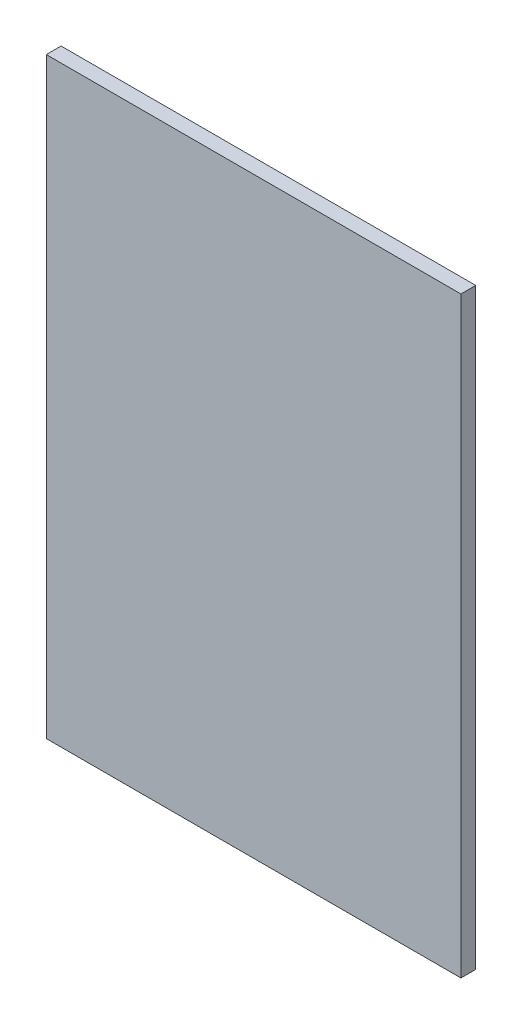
ISO-10303-21;
HEADER;
FILE_DESCRIPTION(('STEP AP214'),'2;1');
FILE_NAME('part.step','',(''),(''),'','','');
FILE_SCHEMA(('AUTOMOTIVE_DESIGN { 1 0 10303 214 1 1 1 1 }'));
ENDSEC;
DATA;
#1=APPLICATION_CONTEXT('core data for automotive mechanical design processes');
#2=APPLICATION_PROTOCOL_DEFINITION('international standard','automotive_design',2000,#1);
#3=PRODUCT_CONTEXT('',#1,'mechanical');
#4=PRODUCT('Part','Part','',(#3));
#5=PRODUCT_RELATED_PRODUCT_CATEGORY('part','',(#4));
#6=PRODUCT_DEFINITION_FORMATION('','',#4);
#7=PRODUCT_DEFINITION_CONTEXT('part definition',#1,'design');
#8=PRODUCT_DEFINITION('design','',#6,#7);
#9=PRODUCT_DEFINITION_SHAPE('','',#8);
#10=(LENGTH_UNIT() NAMED_UNIT(*) SI_UNIT(.MILLI.,.METRE.));
#11=(NAMED_UNIT(*) PLANE_ANGLE_UNIT() SI_UNIT($,.RADIAN.));
#12=(NAMED_UNIT(*) SI_UNIT($,.STERADIAN.) SOLID_ANGLE_UNIT());
#13=UNCERTAINTY_MEASURE_WITH_UNIT(LENGTH_MEASURE(1.E-05),#10,'distance_accuracy_value','');
#14=(GEOMETRIC_REPRESENTATION_CONTEXT(3) GLOBAL_UNCERTAINTY_ASSIGNED_CONTEXT((#13)) GLOBAL_UNIT_ASSIGNED_CONTEXT((#10,
#11,#12)) REPRESENTATION_CONTEXT('',''));
#15=CARTESIAN_POINT('',(0.,0.,0.));
#16=DIRECTION('',(0.,0.,1.));
#17=DIRECTION('',(1.,0.,0.));
#18=AXIS2_PLACEMENT_3D('',#15,#16,#17);
#19=CARTESIAN_POINT('',(177.8,-127.,0.));
#20=DIRECTION('',(0.,1.,0.));
#21=DIRECTION('',(0.,0.,1.));
#22=AXIS2_PLACEMENT_3D('',#19,#20,#21);
#23=PLANE('',#22);
#24=DIRECTION('',(0.,0.,-1.));
#25=VECTOR('',#24,1.);
#26=CARTESIAN_POINT('',(0.,-127.,0.));
#27=LINE('',#26,#25);
#28=CARTESIAN_POINT('',(0.,-127.,0.));
#29=VERTEX_POINT('',#28);
#30=CARTESIAN_POINT('',(0.,-127.,-6.34999999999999));
#31=VERTEX_POINT('',#30);
#32=EDGE_CURVE('E115',#29,#31,#27,.T.);
#33=ORIENTED_EDGE('',*,*,#32,.T.);
#34=DIRECTION('',(-1.,0.,0.));
#35=VECTOR('',#34,1.);
#36=CARTESIAN_POINT('',(177.8,-127.,-6.34999999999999));
#37=LINE('',#36,#35);
#38=CARTESIAN_POINT('',(177.8,-127.,-6.34999999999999));
#39=VERTEX_POINT('',#38);
#40=EDGE_CURVE('E11',#39,#31,#37,.T.);
#41=ORIENTED_EDGE('',*,*,#40,.F.);
#42=DIRECTION('',(0.,0.,-1.));
#43=VECTOR('',#42,1.);
#44=CARTESIAN_POINT('',(177.8,-127.,0.));
#45=LINE('',#44,#43);
#46=CARTESIAN_POINT('',(177.8,-127.,0.));
#47=VERTEX_POINT('',#46);
#48=EDGE_CURVE('E94',#47,#39,#45,.T.);
#49=ORIENTED_EDGE('',*,*,#48,.F.);
#50=DIRECTION('',(-1.,0.,0.));
#51=VECTOR('',#50,1.);
#52=CARTESIAN_POINT('',(177.8,-127.,0.));
#53=LINE('',#52,#51);
#54=EDGE_CURVE('E106',#47,#29,#53,.T.);
#55=ORIENTED_EDGE('',*,*,#54,.T.);
#56=EDGE_LOOP('',(#33,#41,#49,#55));
#57=FACE_BOUND('',#56,.T.);
#58=ADVANCED_FACE('F43',(#57),#23,.F.);
#59=CARTESIAN_POINT('',(177.8,-127.,-6.34999999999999));
#60=DIRECTION('',(0.,0.,1.));
#61=DIRECTION('',(1.,0.,0.));
#62=AXIS2_PLACEMENT_3D('',#59,#60,#61);
#63=PLANE('',#62);
#64=DIRECTION('',(0.,1.,0.));
#65=VECTOR('',#64,1.);
#66=CARTESIAN_POINT('',(0.,-127.,-6.34999999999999));
#67=LINE('',#66,#65);
#68=CARTESIAN_POINT('',(0.,127.,-6.34999999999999));
#69=VERTEX_POINT('',#68);
#70=EDGE_CURVE('E99',#31,#69,#67,.T.);
#71=ORIENTED_EDGE('',*,*,#70,.T.);
#72=DIRECTION('',(-1.,0.,0.));
#73=VECTOR('',#72,1.);
#74=CARTESIAN_POINT('',(177.8,127.,-6.34999999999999));
#75=LINE('',#74,#73);
#76=CARTESIAN_POINT('',(177.8,127.,-6.34999999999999));
#77=VERTEX_POINT('',#76);
#78=EDGE_CURVE('E55',#77,#69,#75,.T.);
#79=ORIENTED_EDGE('',*,*,#78,.F.);
#80=DIRECTION('',(0.,1.,0.));
#81=VECTOR('',#80,1.);
#82=CARTESIAN_POINT('',(177.8,-127.,-6.34999999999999));
#83=LINE('',#82,#81);
#84=EDGE_CURVE('E89',#39,#77,#83,.T.);
#85=ORIENTED_EDGE('',*,*,#84,.F.);
#86=ORIENTED_EDGE('',*,*,#40,.T.);
#87=EDGE_LOOP('',(#71,#79,#85,#86));
#88=FACE_BOUND('',#87,.T.);
#89=ADVANCED_FACE('F98',(#88),#63,.F.);
#90=CARTESIAN_POINT('',(177.8,127.,-6.34999999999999));
#91=DIRECTION('',(0.,-1.,0.));
#92=DIRECTION('',(0.,0.,-1.));
#93=AXIS2_PLACEMENT_3D('',#90,#91,#92);
#94=PLANE('',#93);
#95=DIRECTION('',(0.,0.,1.));
#96=VECTOR('',#95,1.);
#97=CARTESIAN_POINT('',(0.,127.,-6.34999999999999));
#98=LINE('',#97,#96);
#99=CARTESIAN_POINT('',(0.,127.,0.));
#100=VERTEX_POINT('',#99);
#101=EDGE_CURVE('E77',#69,#100,#98,.T.);
#102=ORIENTED_EDGE('',*,*,#101,.T.);
#103=DIRECTION('',(-1.,0.,0.));
#104=VECTOR('',#103,1.);
#105=CARTESIAN_POINT('',(177.8,127.,0.));
#106=LINE('',#105,#104);
#107=CARTESIAN_POINT('',(177.8,127.,0.));
#108=VERTEX_POINT('',#107);
#109=EDGE_CURVE('E105',#108,#100,#106,.T.);
#110=ORIENTED_EDGE('',*,*,#109,.F.);
#111=DIRECTION('',(0.,0.,1.));
#112=VECTOR('',#111,1.);
#113=CARTESIAN_POINT('',(177.8,127.,-6.34999999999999));
#114=LINE('',#113,#112);
#115=EDGE_CURVE('E93',#77,#108,#114,.T.);
#116=ORIENTED_EDGE('',*,*,#115,.F.);
#117=ORIENTED_EDGE('',*,*,#78,.T.);
#118=EDGE_LOOP('',(#102,#110,#116,#117));
#119=FACE_BOUND('',#118,.T.);
#120=ADVANCED_FACE('F104',(#119),#94,.F.);
#121=CARTESIAN_POINT('',(177.8,127.,0.));
#122=DIRECTION('',(0.,0.,-1.));
#123=DIRECTION('',(-1.,0.,0.));
#124=AXIS2_PLACEMENT_3D('',#121,#122,#123);
#125=PLANE('',#124);
#126=DIRECTION('',(0.,-1.,0.));
#127=VECTOR('',#126,1.);
#128=CARTESIAN_POINT('',(0.,127.,0.));
#129=LINE('',#128,#127);
#130=EDGE_CURVE('E81',#100,#29,#129,.T.);
#131=ORIENTED_EDGE('',*,*,#130,.T.);
#132=ORIENTED_EDGE('',*,*,#54,.F.);
#133=DIRECTION('',(0.,-1.,0.));
#134=VECTOR('',#133,1.);
#135=CARTESIAN_POINT('',(177.8,127.,0.));
#136=LINE('',#135,#134);
#137=EDGE_CURVE('E58',#108,#47,#136,.T.);
#138=ORIENTED_EDGE('',*,*,#137,.F.);
#139=ORIENTED_EDGE('',*,*,#109,.T.);
#140=EDGE_LOOP('',(#131,#132,#138,#139));
#141=FACE_BOUND('',#140,.T.);
#142=ADVANCED_FACE('F128',(#141),#125,.F.);
#143=CARTESIAN_POINT('',(177.8,0.,0.));
#144=DIRECTION('',(1.,0.,0.));
#145=DIRECTION('',(0.,0.,-1.));
#146=AXIS2_PLACEMENT_3D('',#143,#144,#145);
#147=PLANE('',#146);
#148=ORIENTED_EDGE('',*,*,#48,.T.);
#149=ORIENTED_EDGE('',*,*,#84,.T.);
#150=ORIENTED_EDGE('',*,*,#115,.T.);
#151=ORIENTED_EDGE('',*,*,#137,.T.);
#152=EDGE_LOOP('',(#148,#149,#150,#151));
#153=FACE_BOUND('',#152,.T.);
#154=ADVANCED_FACE('F91',(#153),#147,.T.);
#155=CARTESIAN_POINT('',(0.,0.,0.));
#156=DIRECTION('',(1.,0.,0.));
#157=DIRECTION('',(0.,0.,-1.));
#158=AXIS2_PLACEMENT_3D('',#155,#156,#157);
#159=PLANE('',#158);
#160=ORIENTED_EDGE('',*,*,#32,.F.);
#161=ORIENTED_EDGE('',*,*,#130,.F.);
#162=ORIENTED_EDGE('',*,*,#101,.F.);
#163=ORIENTED_EDGE('',*,*,#70,.F.);
#164=EDGE_LOOP('',(#160,#161,#162,#163));
#165=FACE_BOUND('',#164,.T.);
#166=ADVANCED_FACE('F129',(#165),#159,.F.);
#167=CLOSED_SHELL('',(#58,#89,#120,#142,#154,#166));
#168=MANIFOLD_SOLID_BREP('B2',#167);
#169=ADVANCED_BREP_SHAPE_REPRESENTATION('',(#18,#168),#14);
#170=SHAPE_DEFINITION_REPRESENTATION(#9,#169);
ENDSEC;
END-ISO-10303-21;
